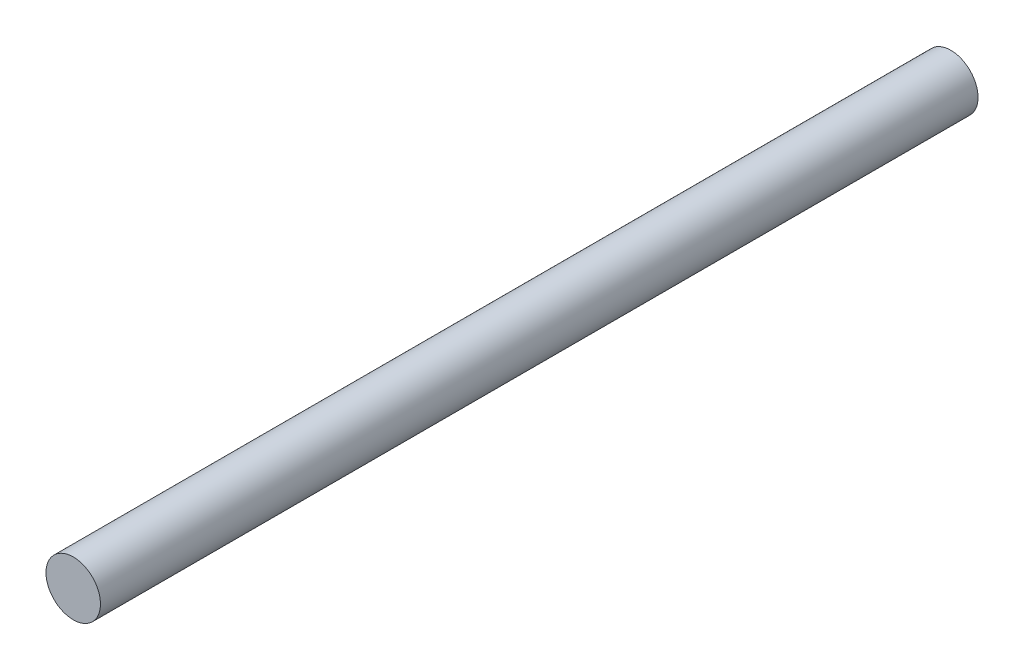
ISO-10303-21;
HEADER;
FILE_DESCRIPTION(('STEP AP214'),'2;1');
FILE_NAME('part.step','',(''),(''),'','','');
FILE_SCHEMA(('AUTOMOTIVE_DESIGN { 1 0 10303 214 1 1 1 1 }'));
ENDSEC;
DATA;
#1=APPLICATION_CONTEXT('core data for automotive mechanical design processes');
#2=APPLICATION_PROTOCOL_DEFINITION('international standard','automotive_design',2000,#1);
#3=PRODUCT_CONTEXT('',#1,'mechanical');
#4=PRODUCT('Part','Part','',(#3));
#5=PRODUCT_RELATED_PRODUCT_CATEGORY('part','',(#4));
#6=PRODUCT_DEFINITION_FORMATION('','',#4);
#7=PRODUCT_DEFINITION_CONTEXT('part definition',#1,'design');
#8=PRODUCT_DEFINITION('design','',#6,#7);
#9=PRODUCT_DEFINITION_SHAPE('','',#8);
#10=(LENGTH_UNIT() NAMED_UNIT(*) SI_UNIT(.MILLI.,.METRE.));
#11=(NAMED_UNIT(*) PLANE_ANGLE_UNIT() SI_UNIT($,.RADIAN.));
#12=(NAMED_UNIT(*) SI_UNIT($,.STERADIAN.) SOLID_ANGLE_UNIT());
#13=UNCERTAINTY_MEASURE_WITH_UNIT(LENGTH_MEASURE(1.E-05),#10,'distance_accuracy_value','');
#14=(GEOMETRIC_REPRESENTATION_CONTEXT(3) GLOBAL_UNCERTAINTY_ASSIGNED_CONTEXT((#13)) GLOBAL_UNIT_ASSIGNED_CONTEXT((#10,
#11,#12)) REPRESENTATION_CONTEXT('',''));
#15=CARTESIAN_POINT('',(0.,0.,0.));
#16=DIRECTION('',(0.,0.,1.));
#17=DIRECTION('',(1.,0.,0.));
#18=AXIS2_PLACEMENT_3D('',#15,#16,#17);
#19=CARTESIAN_POINT('',(0.,0.,48.32));
#20=DIRECTION('',(0.,0.,-1.));
#21=DIRECTION('',(-1.,0.,0.));
#22=AXIS2_PLACEMENT_3D('',#19,#20,#21);
#23=CYLINDRICAL_SURFACE('',#22,1.5);
#24=CARTESIAN_POINT('',(0.,0.,48.32));
#25=DIRECTION('',(0.,0.,1.));
#26=DIRECTION('',(1.,0.,0.));
#27=AXIS2_PLACEMENT_3D('',#24,#25,#26);
#28=CIRCLE('',#27,1.5);
#29=CARTESIAN_POINT('',(-1.5,0.,48.32));
#30=VERTEX_POINT('',#29);
#31=EDGE_CURVE('E10',#30,#30,#28,.T.);
#32=CARTESIAN_POINT('',(0.,0.,0.));
#33=DIRECTION('',(0.,0.,1.));
#34=DIRECTION('',(1.,0.,0.));
#35=AXIS2_PLACEMENT_3D('',#32,#33,#34);
#36=CIRCLE('',#35,1.5);
#37=CARTESIAN_POINT('',(-1.5,0.,0.));
#38=VERTEX_POINT('',#37);
#39=EDGE_CURVE('E46',#38,#38,#36,.T.);
#40=CARTESIAN_POINT('',(-1.5,0.,48.32));
#41=CARTESIAN_POINT('',(-1.5,0.,47.8166666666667));
#42=CARTESIAN_POINT('',(-1.5,0.,47.3133333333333));
#43=CARTESIAN_POINT('',(-1.5,0.,46.3066666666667));
#44=CARTESIAN_POINT('',(-1.5,0.,45.8033333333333));
#45=CARTESIAN_POINT('',(-1.5,0.,44.7966666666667));
#46=CARTESIAN_POINT('',(-1.5,0.,44.2933333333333));
#47=CARTESIAN_POINT('',(-1.5,0.,43.2866666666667));
#48=CARTESIAN_POINT('',(-1.5,0.,42.7833333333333));
#49=CARTESIAN_POINT('',(-1.5,0.,41.7766666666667));
#50=CARTESIAN_POINT('',(-1.5,0.,41.2733333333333));
#51=CARTESIAN_POINT('',(-1.5,0.,40.2666666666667));
#52=CARTESIAN_POINT('',(-1.5,0.,39.7633333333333));
#53=CARTESIAN_POINT('',(-1.5,0.,38.7566666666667));
#54=CARTESIAN_POINT('',(-1.5,0.,38.2533333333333));
#55=CARTESIAN_POINT('',(-1.5,0.,37.2466666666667));
#56=CARTESIAN_POINT('',(-1.5,0.,36.7433333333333));
#57=CARTESIAN_POINT('',(-1.5,0.,35.7366666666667));
#58=CARTESIAN_POINT('',(-1.5,0.,35.2333333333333));
#59=CARTESIAN_POINT('',(-1.5,0.,34.2266666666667));
#60=CARTESIAN_POINT('',(-1.5,0.,33.7233333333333));
#61=CARTESIAN_POINT('',(-1.5,0.,32.7166666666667));
#62=CARTESIAN_POINT('',(-1.5,0.,32.2133333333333));
#63=CARTESIAN_POINT('',(-1.5,0.,31.2066666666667));
#64=CARTESIAN_POINT('',(-1.5,0.,30.7033333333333));
#65=CARTESIAN_POINT('',(-1.5,0.,29.6966666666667));
#66=CARTESIAN_POINT('',(-1.5,0.,29.1933333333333));
#67=CARTESIAN_POINT('',(-1.5,0.,28.1866666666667));
#68=CARTESIAN_POINT('',(-1.5,0.,27.6833333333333));
#69=CARTESIAN_POINT('',(-1.5,0.,26.6766666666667));
#70=CARTESIAN_POINT('',(-1.5,0.,26.1733333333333));
#71=CARTESIAN_POINT('',(-1.5,0.,25.1666666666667));
#72=CARTESIAN_POINT('',(-1.5,0.,24.6633333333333));
#73=CARTESIAN_POINT('',(-1.5,0.,23.6566666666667));
#74=CARTESIAN_POINT('',(-1.5,0.,23.1533333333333));
#75=CARTESIAN_POINT('',(-1.5,0.,22.1466666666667));
#76=CARTESIAN_POINT('',(-1.5,0.,21.6433333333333));
#77=CARTESIAN_POINT('',(-1.5,0.,20.6366666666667));
#78=CARTESIAN_POINT('',(-1.5,0.,20.1333333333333));
#79=CARTESIAN_POINT('',(-1.5,0.,19.1266666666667));
#80=CARTESIAN_POINT('',(-1.5,0.,18.6233333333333));
#81=CARTESIAN_POINT('',(-1.5,0.,17.6166666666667));
#82=CARTESIAN_POINT('',(-1.5,0.,17.1133333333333));
#83=CARTESIAN_POINT('',(-1.5,0.,16.1066666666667));
#84=CARTESIAN_POINT('',(-1.5,0.,15.6033333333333));
#85=CARTESIAN_POINT('',(-1.5,0.,14.5966666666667));
#86=CARTESIAN_POINT('',(-1.5,0.,14.0933333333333));
#87=CARTESIAN_POINT('',(-1.5,0.,13.0866666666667));
#88=CARTESIAN_POINT('',(-1.5,0.,12.5833333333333));
#89=CARTESIAN_POINT('',(-1.5,0.,11.5766666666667));
#90=CARTESIAN_POINT('',(-1.5,0.,11.0733333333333));
#91=CARTESIAN_POINT('',(-1.5,0.,10.0666666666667));
#92=CARTESIAN_POINT('',(-1.5,0.,9.56333333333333));
#93=CARTESIAN_POINT('',(-1.5,0.,8.55666666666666));
#94=CARTESIAN_POINT('',(-1.5,0.,8.05333333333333));
#95=CARTESIAN_POINT('',(-1.5,0.,7.04666666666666));
#96=CARTESIAN_POINT('',(-1.5,0.,6.54333333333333));
#97=CARTESIAN_POINT('',(-1.5,0.,5.53666666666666));
#98=CARTESIAN_POINT('',(-1.5,0.,5.03333333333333));
#99=CARTESIAN_POINT('',(-1.5,0.,4.02666666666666));
#100=CARTESIAN_POINT('',(-1.5,0.,3.52333333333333));
#101=CARTESIAN_POINT('',(-1.5,0.,2.51666666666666));
#102=CARTESIAN_POINT('',(-1.5,0.,2.01333333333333));
#103=CARTESIAN_POINT('',(-1.5,0.,1.00666666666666));
#104=CARTESIAN_POINT('',(-1.5,0.,0.503333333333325));
#105=CARTESIAN_POINT('',(-1.5,0.,0.));
#106=B_SPLINE_CURVE_WITH_KNOTS('',3,(#40,#41,#42,#43,#44,#45,#46,#47,#48,#49,#50,#51,#52,#53,
#54,#55,#56,#57,#58,#59,#60,#61,#62,#63,#64,#65,#66,#67,#68,#69,#70,#71,#72,#73,#74,#75,#76,#77,
#78,#79,#80,#81,#82,#83,#84,#85,#86,#87,#88,#89,#90,#91,#92,#93,#94,#95,#96,#97,#98,#99,#100,
#101,#102,#103,#104,#105),.UNSPECIFIED.,.F.,.F.,(4,2,2,2,2,2,2,2,2,2,2,2,2,2,2,2,2,2,2,2,2,2,2,
2,2,2,2,2,2,2,2,2,4),(0.,1.51,3.02,4.53,6.04,7.54999999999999,9.06,10.57,12.08,13.59,15.1,16.61,
18.12,19.63,21.14,22.65,24.16,25.67,27.18,28.69,30.2,31.71,33.22,34.73,36.24,37.75,39.26,40.77,
42.28,43.79,45.3,46.81,48.32),.UNSPECIFIED.);
#107=EDGE_CURVE('BSEAM43',#30,#38,#106,.T.);
#108=ORIENTED_EDGE('',*,*,#31,.F.);
#109=ORIENTED_EDGE('',*,*,#39,.T.);
#110=ORIENTED_EDGE('',*,*,#107,.T.);
#111=ORIENTED_EDGE('',*,*,#107,.F.);
#112=EDGE_LOOP('',(#108,#110,#109,#111));
#113=FACE_BOUND('',#112,.T.);
#114=ADVANCED_FACE('F43',(#113),#23,.T.);
#115=CARTESIAN_POINT('',(0.,0.,48.32));
#116=DIRECTION('',(0.,0.,1.));
#117=DIRECTION('',(1.,0.,0.));
#118=AXIS2_PLACEMENT_3D('',#115,#116,#117);
#119=PLANE('',#118);
#120=ORIENTED_EDGE('',*,*,#31,.T.);
#121=EDGE_LOOP('',(#120));
#122=FACE_BOUND('',#121,.T.);
#123=ADVANCED_FACE('F60',(#122),#119,.T.);
#124=CARTESIAN_POINT('',(0.,0.,0.));
#125=DIRECTION('',(0.,0.,1.));
#126=DIRECTION('',(1.,0.,0.));
#127=AXIS2_PLACEMENT_3D('',#124,#125,#126);
#128=PLANE('',#127);
#129=ORIENTED_EDGE('',*,*,#39,.F.);
#130=EDGE_LOOP('',(#129));
#131=FACE_BOUND('',#130,.T.);
#132=ADVANCED_FACE('F58',(#131),#128,.F.);
#133=CLOSED_SHELL('',(#114,#123,#132));
#134=MANIFOLD_SOLID_BREP('B2',#133);
#135=ADVANCED_BREP_SHAPE_REPRESENTATION('',(#18,#134),#14);
#136=SHAPE_DEFINITION_REPRESENTATION(#9,#135);
ENDSEC;
END-ISO-10303-21;
